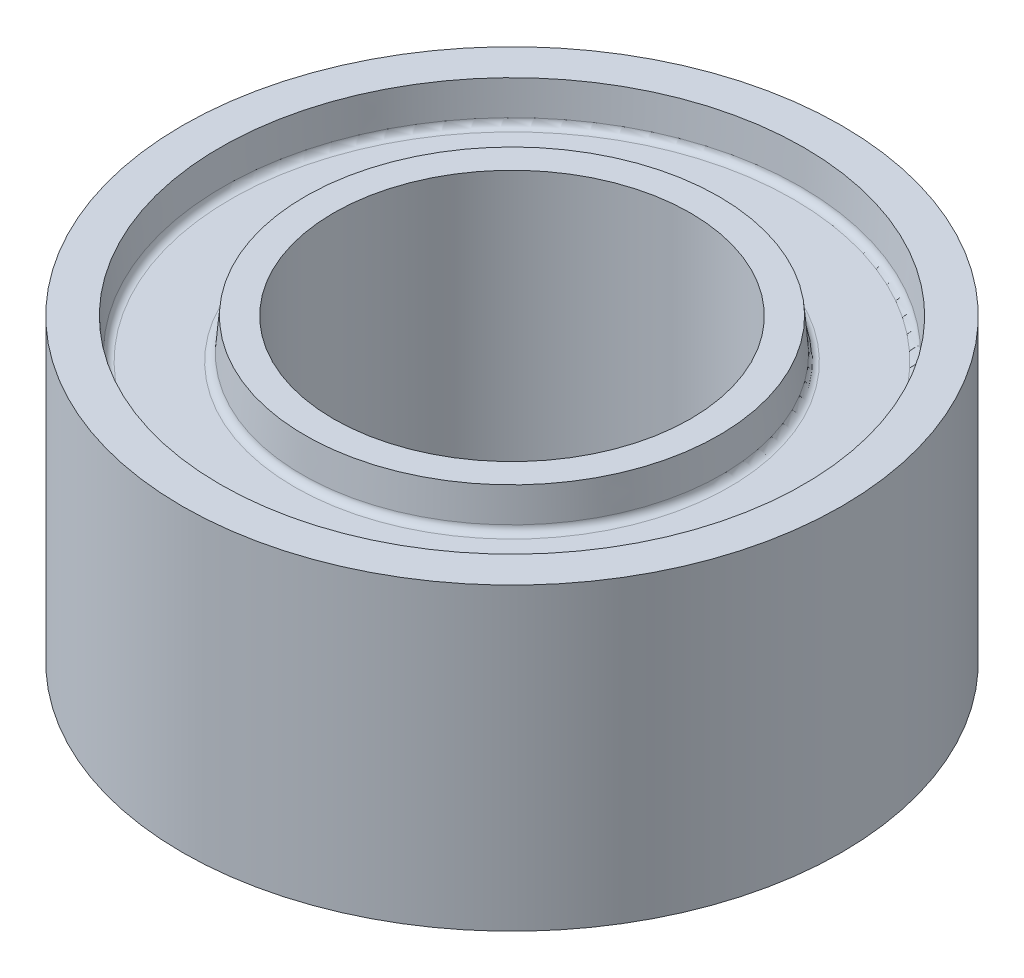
from build123d import *

# Parameters (mm, degrees)
SKETCH1_R           = 10.998522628
SKETCH1_R_2         = 5.95249
BOSS_EXTRUDE1_DEPTH = 10


with BuildPart() as part:
    # Sketch1 → Boss-Extrude1 (new body)
    with BuildSketch(Plane(origin=(0, 0, 0), x_dir=(1, 0, 0), z_dir=(0, 1, 0))):
        with Locations(Location((0, 0, 0), (0, 0, 270))):
            Circle(SKETCH1_R)
        with Locations(Location((0, 0, 0), (0, 0, 270))):
            Circle(SKETCH1_R_2, mode=Mode.SUBTRACT)
    extrude(amount=BOSS_EXTRUDE1_DEPTH)

    # Sketch2 → Groove for AS 568-015_ O-Ring1 (revolve, cut)
    with BuildSketch(Plane(origin=(0, 10, 0), x_dir=(0, 0, 1), z_dir=(-1, 0, 0)), mode=Mode.PRIVATE) as groove_for_as_568_015_o_ring1_sk:
        with BuildLine():
            Line((6.9977, -1.088937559), (6.902430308, 0))
            Line((6.902430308, 0), (9.734569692, 0))
            Line((9.734569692, 0), (9.6393, -1.088937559))
            ThreePointArc((9.6393, -1.088937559), (9.557866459, -1.254068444), (9.386266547, -1.3208))
            Line((9.386266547, -1.3208), (7.250733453, -1.3208))
            ThreePointArc((7.250733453, -1.3208), (7.079133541, -1.254068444), (6.9977, -1.088937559))
        make_face()
    revolve(groove_for_as_568_015_o_ring1_sk.sketch.rotate(Axis((0, 60, 0), (0, -1, 0)), 180), axis=Axis((0, 60, 0), (0, -1, 0)), mode=Mode.SUBTRACT)


solid = part.part
